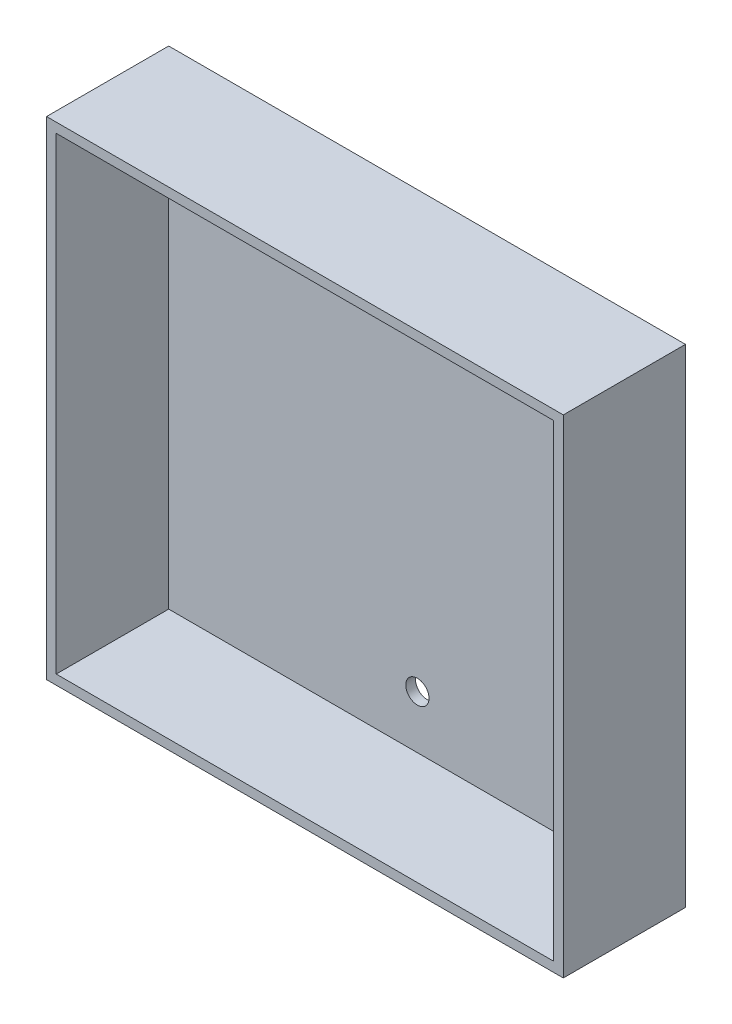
ISO-10303-21;
HEADER;
FILE_DESCRIPTION(('STEP AP214'),'2;1');
FILE_NAME('part.step','',(''),(''),'','','');
FILE_SCHEMA(('AUTOMOTIVE_DESIGN { 1 0 10303 214 1 1 1 1 }'));
ENDSEC;
DATA;
#1=APPLICATION_CONTEXT('core data for automotive mechanical design processes');
#2=APPLICATION_PROTOCOL_DEFINITION('international standard','automotive_design',2000,#1);
#3=PRODUCT_CONTEXT('',#1,'mechanical');
#4=PRODUCT('Part','Part','',(#3));
#5=PRODUCT_RELATED_PRODUCT_CATEGORY('part','',(#4));
#6=PRODUCT_DEFINITION_FORMATION('','',#4);
#7=PRODUCT_DEFINITION_CONTEXT('part definition',#1,'design');
#8=PRODUCT_DEFINITION('design','',#6,#7);
#9=PRODUCT_DEFINITION_SHAPE('','',#8);
#10=(LENGTH_UNIT() NAMED_UNIT(*) SI_UNIT(.MILLI.,.METRE.));
#11=(NAMED_UNIT(*) PLANE_ANGLE_UNIT() SI_UNIT($,.RADIAN.));
#12=(NAMED_UNIT(*) SI_UNIT($,.STERADIAN.) SOLID_ANGLE_UNIT());
#13=UNCERTAINTY_MEASURE_WITH_UNIT(LENGTH_MEASURE(1.E-05),#10,'distance_accuracy_value','');
#14=(GEOMETRIC_REPRESENTATION_CONTEXT(3) GLOBAL_UNCERTAINTY_ASSIGNED_CONTEXT((#13)) GLOBAL_UNIT_ASSIGNED_CONTEXT((#10,
#11,#12)) REPRESENTATION_CONTEXT('',''));
#15=CARTESIAN_POINT('',(0.,0.,0.));
#16=DIRECTION('',(0.,0.,1.));
#17=DIRECTION('',(1.,0.,0.));
#18=AXIS2_PLACEMENT_3D('',#15,#16,#17);
#19=CARTESIAN_POINT('',(0.,50.3,12.6));
#20=DIRECTION('',(0.,0.,-1.));
#21=DIRECTION('',(-1.,0.,0.));
#22=AXIS2_PLACEMENT_3D('',#19,#20,#21);
#23=PLANE('',#22);
#24=DIRECTION('',(0.,-1.,0.));
#25=VECTOR('',#24,1.);
#26=CARTESIAN_POINT('',(0.,0.,12.6));
#27=LINE('',#26,#25);
#28=CARTESIAN_POINT('',(0.,50.3,12.6));
#29=VERTEX_POINT('',#28);
#30=CARTESIAN_POINT('',(0.,0.,12.6));
#31=VERTEX_POINT('',#30);
#32=EDGE_CURVE('E135',#29,#31,#27,.T.);
#33=ORIENTED_EDGE('',*,*,#32,.T.);
#34=DIRECTION('',(1.,0.,0.));
#35=VECTOR('',#34,1.);
#36=CARTESIAN_POINT('',(0.,0.,12.6));
#37=LINE('',#36,#35);
#38=CARTESIAN_POINT('',(53.3,0.,12.6));
#39=VERTEX_POINT('',#38);
#40=EDGE_CURVE('E137',#31,#39,#37,.T.);
#41=ORIENTED_EDGE('',*,*,#40,.T.);
#42=DIRECTION('',(0.,1.,0.));
#43=VECTOR('',#42,1.);
#44=CARTESIAN_POINT('',(53.3,0.,12.6));
#45=LINE('',#44,#43);
#46=CARTESIAN_POINT('',(53.3,50.3,12.6));
#47=VERTEX_POINT('',#46);
#48=EDGE_CURVE('E139',#39,#47,#45,.T.);
#49=ORIENTED_EDGE('',*,*,#48,.T.);
#50=DIRECTION('',(-1.,0.,0.));
#51=VECTOR('',#50,1.);
#52=CARTESIAN_POINT('',(0.,50.3,12.6));
#53=LINE('',#52,#51);
#54=EDGE_CURVE('E49',#47,#29,#53,.T.);
#55=ORIENTED_EDGE('',*,*,#54,.T.);
#56=EDGE_LOOP('',(#33,#41,#49,#55));
#57=FACE_BOUND('',#56,.T.);
#58=DIRECTION('',(0.,-1.,0.));
#59=VECTOR('',#58,1.);
#60=CARTESIAN_POINT('',(1.,50.3,12.6));
#61=LINE('',#60,#59);
#62=CARTESIAN_POINT('',(1.,49.3,12.6));
#63=VERTEX_POINT('',#62);
#64=CARTESIAN_POINT('',(1.,1.,12.6));
#65=VERTEX_POINT('',#64);
#66=EDGE_CURVE('E115',#63,#65,#61,.T.);
#67=ORIENTED_EDGE('',*,*,#66,.F.);
#68=DIRECTION('',(-1.,0.,0.));
#69=VECTOR('',#68,1.);
#70=CARTESIAN_POINT('',(0.,49.3,12.6));
#71=LINE('',#70,#69);
#72=CARTESIAN_POINT('',(52.3,49.3,12.6));
#73=VERTEX_POINT('',#72);
#74=EDGE_CURVE('E124',#73,#63,#71,.T.);
#75=ORIENTED_EDGE('',*,*,#74,.F.);
#76=DIRECTION('',(0.,1.,0.));
#77=VECTOR('',#76,1.);
#78=CARTESIAN_POINT('',(52.3,50.3,12.6));
#79=LINE('',#78,#77);
#80=CARTESIAN_POINT('',(52.3,1.,12.6));
#81=VERTEX_POINT('',#80);
#82=EDGE_CURVE('E122',#81,#73,#79,.T.);
#83=ORIENTED_EDGE('',*,*,#82,.F.);
#84=DIRECTION('',(1.,0.,0.));
#85=VECTOR('',#84,1.);
#86=CARTESIAN_POINT('',(0.,1.,12.6));
#87=LINE('',#86,#85);
#88=EDGE_CURVE('E107',#65,#81,#87,.T.);
#89=ORIENTED_EDGE('',*,*,#88,.F.);
#90=EDGE_LOOP('',(#67,#75,#83,#89));
#91=FACE_BOUND('',#90,.T.);
#92=ADVANCED_FACE('F26',(#57,#91),#23,.F.);
#93=CARTESIAN_POINT('',(0.,0.,12.6));
#94=DIRECTION('',(1.,0.,0.));
#95=DIRECTION('',(0.,0.,-1.));
#96=AXIS2_PLACEMENT_3D('',#93,#94,#95);
#97=PLANE('',#96);
#98=DIRECTION('',(0.,-1.,0.));
#99=VECTOR('',#98,1.);
#100=CARTESIAN_POINT('',(0.,0.,0.));
#101=LINE('',#100,#99);
#102=CARTESIAN_POINT('',(0.,50.3,0.));
#103=VERTEX_POINT('',#102);
#104=CARTESIAN_POINT('',(0.,0.,0.));
#105=VERTEX_POINT('',#104);
#106=EDGE_CURVE('E126',#103,#105,#101,.T.);
#107=ORIENTED_EDGE('',*,*,#106,.T.);
#108=DIRECTION('',(0.,0.,-1.));
#109=VECTOR('',#108,1.);
#110=CARTESIAN_POINT('',(0.,0.,12.6));
#111=LINE('',#110,#109);
#112=EDGE_CURVE('E11',#31,#105,#111,.T.);
#113=ORIENTED_EDGE('',*,*,#112,.F.);
#114=ORIENTED_EDGE('',*,*,#32,.F.);
#115=DIRECTION('',(0.,0.,-1.));
#116=VECTOR('',#115,1.);
#117=CARTESIAN_POINT('',(0.,50.3,12.6));
#118=LINE('',#117,#116);
#119=EDGE_CURVE('E142',#29,#103,#118,.T.);
#120=ORIENTED_EDGE('',*,*,#119,.T.);
#121=EDGE_LOOP('',(#107,#113,#114,#120));
#122=FACE_BOUND('',#121,.T.);
#123=ADVANCED_FACE('F28',(#122),#97,.F.);
#124=CARTESIAN_POINT('',(0.,0.,12.6));
#125=DIRECTION('',(0.,1.,0.));
#126=DIRECTION('',(0.,0.,1.));
#127=AXIS2_PLACEMENT_3D('',#124,#125,#126);
#128=PLANE('',#127);
#129=DIRECTION('',(1.,0.,0.));
#130=VECTOR('',#129,1.);
#131=CARTESIAN_POINT('',(0.,0.,0.));
#132=LINE('',#131,#130);
#133=CARTESIAN_POINT('',(53.3,0.,0.));
#134=VERTEX_POINT('',#133);
#135=EDGE_CURVE('E129',#105,#134,#132,.T.);
#136=ORIENTED_EDGE('',*,*,#135,.T.);
#137=DIRECTION('',(0.,0.,-1.));
#138=VECTOR('',#137,1.);
#139=CARTESIAN_POINT('',(53.3,0.,12.6));
#140=LINE('',#139,#138);
#141=EDGE_CURVE('E34',#39,#134,#140,.T.);
#142=ORIENTED_EDGE('',*,*,#141,.F.);
#143=ORIENTED_EDGE('',*,*,#40,.F.);
#144=ORIENTED_EDGE('',*,*,#112,.T.);
#145=EDGE_LOOP('',(#136,#142,#143,#144));
#146=FACE_BOUND('',#145,.T.);
#147=ADVANCED_FACE('F165',(#146),#128,.F.);
#148=CARTESIAN_POINT('',(53.3,0.,12.6));
#149=DIRECTION('',(-1.,0.,0.));
#150=DIRECTION('',(0.,0.,1.));
#151=AXIS2_PLACEMENT_3D('',#148,#149,#150);
#152=PLANE('',#151);
#153=DIRECTION('',(0.,1.,0.));
#154=VECTOR('',#153,1.);
#155=CARTESIAN_POINT('',(53.3,0.,0.));
#156=LINE('',#155,#154);
#157=CARTESIAN_POINT('',(53.3,50.3,0.));
#158=VERTEX_POINT('',#157);
#159=EDGE_CURVE('E131',#134,#158,#156,.T.);
#160=ORIENTED_EDGE('',*,*,#159,.T.);
#161=DIRECTION('',(0.,0.,-1.));
#162=VECTOR('',#161,1.);
#163=CARTESIAN_POINT('',(53.3,50.3,12.6));
#164=LINE('',#163,#162);
#165=EDGE_CURVE('E145',#47,#158,#164,.T.);
#166=ORIENTED_EDGE('',*,*,#165,.F.);
#167=ORIENTED_EDGE('',*,*,#48,.F.);
#168=ORIENTED_EDGE('',*,*,#141,.T.);
#169=EDGE_LOOP('',(#160,#166,#167,#168));
#170=FACE_BOUND('',#169,.T.);
#171=ADVANCED_FACE('F152',(#170),#152,.F.);
#172=CARTESIAN_POINT('',(0.,50.3,12.6));
#173=DIRECTION('',(0.,-1.,0.));
#174=DIRECTION('',(0.,0.,-1.));
#175=AXIS2_PLACEMENT_3D('',#172,#173,#174);
#176=PLANE('',#175);
#177=DIRECTION('',(-1.,0.,0.));
#178=VECTOR('',#177,1.);
#179=CARTESIAN_POINT('',(0.,50.3,0.));
#180=LINE('',#179,#178);
#181=EDGE_CURVE('E133',#158,#103,#180,.T.);
#182=ORIENTED_EDGE('',*,*,#181,.T.);
#183=ORIENTED_EDGE('',*,*,#119,.F.);
#184=ORIENTED_EDGE('',*,*,#54,.F.);
#185=ORIENTED_EDGE('',*,*,#165,.T.);
#186=EDGE_LOOP('',(#182,#183,#184,#185));
#187=FACE_BOUND('',#186,.T.);
#188=ADVANCED_FACE('F160',(#187),#176,.F.);
#189=CARTESIAN_POINT('',(0.,50.3,0.));
#190=DIRECTION('',(0.,0.,-1.));
#191=DIRECTION('',(-1.,0.,0.));
#192=AXIS2_PLACEMENT_3D('',#189,#190,#191);
#193=PLANE('',#192);
#194=CARTESIAN_POINT('',(26.65,6.45,0.));
#195=DIRECTION('',(0.,0.,1.));
#196=DIRECTION('',(1.,0.,0.));
#197=AXIS2_PLACEMENT_3D('',#194,#195,#196);
#198=CIRCLE('',#197,1.2);
#199=CARTESIAN_POINT('',(27.85,6.45,0.));
#200=VERTEX_POINT('',#199);
#201=EDGE_CURVE('E195',#200,#200,#198,.T.);
#202=ORIENTED_EDGE('',*,*,#201,.T.);
#203=EDGE_LOOP('',(#202));
#204=FACE_BOUND('',#203,.T.);
#205=CARTESIAN_POINT('',(26.65,43.85,0.));
#206=DIRECTION('',(0.,0.,1.));
#207=DIRECTION('',(1.,0.,0.));
#208=AXIS2_PLACEMENT_3D('',#205,#206,#207);
#209=CIRCLE('',#208,1.2);
#210=CARTESIAN_POINT('',(27.85,43.85,0.));
#211=VERTEX_POINT('',#210);
#212=EDGE_CURVE('E198',#211,#211,#209,.T.);
#213=ORIENTED_EDGE('',*,*,#212,.T.);
#214=EDGE_LOOP('',(#213));
#215=FACE_BOUND('',#214,.T.);
#216=ORIENTED_EDGE('',*,*,#106,.F.);
#217=ORIENTED_EDGE('',*,*,#181,.F.);
#218=ORIENTED_EDGE('',*,*,#159,.F.);
#219=ORIENTED_EDGE('',*,*,#135,.F.);
#220=EDGE_LOOP('',(#216,#217,#218,#219));
#221=FACE_BOUND('',#220,.T.);
#222=ADVANCED_FACE('F158',(#204,#215,#221),#193,.T.);
#223=CARTESIAN_POINT('',(1.,0.,12.6));
#224=DIRECTION('',(1.,0.,0.));
#225=DIRECTION('',(0.,0.,-1.));
#226=AXIS2_PLACEMENT_3D('',#223,#224,#225);
#227=PLANE('',#226);
#228=DIRECTION('',(0.,-1.,0.));
#229=VECTOR('',#228,1.);
#230=CARTESIAN_POINT('',(1.,50.3,1.));
#231=LINE('',#230,#229);
#232=CARTESIAN_POINT('',(1.,49.3,1.));
#233=VERTEX_POINT('',#232);
#234=CARTESIAN_POINT('',(1.,1.,1.));
#235=VERTEX_POINT('',#234);
#236=EDGE_CURVE('E98',#233,#235,#231,.T.);
#237=ORIENTED_EDGE('',*,*,#236,.F.);
#238=DIRECTION('',(0.,0.,-1.));
#239=VECTOR('',#238,1.);
#240=CARTESIAN_POINT('',(1.,49.3,12.6));
#241=LINE('',#240,#239);
#242=EDGE_CURVE('E118',#63,#233,#241,.T.);
#243=ORIENTED_EDGE('',*,*,#242,.F.);
#244=ORIENTED_EDGE('',*,*,#66,.T.);
#245=DIRECTION('',(0.,0.,-1.));
#246=VECTOR('',#245,1.);
#247=CARTESIAN_POINT('',(1.,1.,12.6));
#248=LINE('',#247,#246);
#249=EDGE_CURVE('E110',#65,#235,#248,.T.);
#250=ORIENTED_EDGE('',*,*,#249,.T.);
#251=EDGE_LOOP('',(#237,#243,#244,#250));
#252=FACE_BOUND('',#251,.T.);
#253=ADVANCED_FACE('F184',(#252),#227,.T.);
#254=CARTESIAN_POINT('',(0.,1.,12.6));
#255=DIRECTION('',(0.,1.,0.));
#256=DIRECTION('',(0.,0.,1.));
#257=AXIS2_PLACEMENT_3D('',#254,#255,#256);
#258=PLANE('',#257);
#259=DIRECTION('',(1.,0.,0.));
#260=VECTOR('',#259,1.);
#261=CARTESIAN_POINT('',(0.,1.,1.));
#262=LINE('',#261,#260);
#263=CARTESIAN_POINT('',(52.3,1.,1.));
#264=VERTEX_POINT('',#263);
#265=EDGE_CURVE('E92',#235,#264,#262,.T.);
#266=ORIENTED_EDGE('',*,*,#265,.F.);
#267=ORIENTED_EDGE('',*,*,#249,.F.);
#268=ORIENTED_EDGE('',*,*,#88,.T.);
#269=DIRECTION('',(0.,0.,-1.));
#270=VECTOR('',#269,1.);
#271=CARTESIAN_POINT('',(52.3,1.,12.6));
#272=LINE('',#271,#270);
#273=EDGE_CURVE('E104',#81,#264,#272,.T.);
#274=ORIENTED_EDGE('',*,*,#273,.T.);
#275=EDGE_LOOP('',(#266,#267,#268,#274));
#276=FACE_BOUND('',#275,.T.);
#277=ADVANCED_FACE('F105',(#276),#258,.T.);
#278=CARTESIAN_POINT('',(52.3,0.,12.6));
#279=DIRECTION('',(-1.,0.,0.));
#280=DIRECTION('',(0.,0.,1.));
#281=AXIS2_PLACEMENT_3D('',#278,#279,#280);
#282=PLANE('',#281);
#283=DIRECTION('',(0.,1.,0.));
#284=VECTOR('',#283,1.);
#285=CARTESIAN_POINT('',(52.3,50.3,1.));
#286=LINE('',#285,#284);
#287=CARTESIAN_POINT('',(52.3,49.3,1.));
#288=VERTEX_POINT('',#287);
#289=EDGE_CURVE('E96',#264,#288,#286,.T.);
#290=ORIENTED_EDGE('',*,*,#289,.F.);
#291=ORIENTED_EDGE('',*,*,#273,.F.);
#292=ORIENTED_EDGE('',*,*,#82,.T.);
#293=DIRECTION('',(0.,0.,-1.));
#294=VECTOR('',#293,1.);
#295=CARTESIAN_POINT('',(52.3,49.3,12.6));
#296=LINE('',#295,#294);
#297=EDGE_CURVE('E41',#73,#288,#296,.T.);
#298=ORIENTED_EDGE('',*,*,#297,.T.);
#299=EDGE_LOOP('',(#290,#291,#292,#298));
#300=FACE_BOUND('',#299,.T.);
#301=ADVANCED_FACE('F112',(#300),#282,.T.);
#302=CARTESIAN_POINT('',(0.,49.3,12.6));
#303=DIRECTION('',(0.,-1.,0.));
#304=DIRECTION('',(0.,0.,-1.));
#305=AXIS2_PLACEMENT_3D('',#302,#303,#304);
#306=PLANE('',#305);
#307=DIRECTION('',(-1.,0.,0.));
#308=VECTOR('',#307,1.);
#309=CARTESIAN_POINT('',(0.,49.3,1.));
#310=LINE('',#309,#308);
#311=EDGE_CURVE('E113',#288,#233,#310,.T.);
#312=ORIENTED_EDGE('',*,*,#311,.F.);
#313=ORIENTED_EDGE('',*,*,#297,.F.);
#314=ORIENTED_EDGE('',*,*,#74,.T.);
#315=ORIENTED_EDGE('',*,*,#242,.T.);
#316=EDGE_LOOP('',(#312,#313,#314,#315));
#317=FACE_BOUND('',#316,.T.);
#318=ADVANCED_FACE('F210',(#317),#306,.T.);
#319=CARTESIAN_POINT('',(0.,50.3,1.));
#320=DIRECTION('',(0.,0.,-1.));
#321=DIRECTION('',(-1.,0.,0.));
#322=AXIS2_PLACEMENT_3D('',#319,#320,#321);
#323=PLANE('',#322);
#324=CARTESIAN_POINT('',(26.65,6.45,1.));
#325=DIRECTION('',(0.,0.,1.));
#326=DIRECTION('',(1.,0.,0.));
#327=AXIS2_PLACEMENT_3D('',#324,#325,#326);
#328=CIRCLE('',#327,1.2);
#329=CARTESIAN_POINT('',(27.85,6.45,1.));
#330=VERTEX_POINT('',#329);
#331=EDGE_CURVE('E233',#330,#330,#328,.T.);
#332=ORIENTED_EDGE('',*,*,#331,.F.);
#333=EDGE_LOOP('',(#332));
#334=FACE_BOUND('',#333,.T.);
#335=CARTESIAN_POINT('',(26.65,43.85,1.));
#336=DIRECTION('',(0.,0.,1.));
#337=DIRECTION('',(1.,0.,0.));
#338=AXIS2_PLACEMENT_3D('',#335,#336,#337);
#339=CIRCLE('',#338,1.2);
#340=CARTESIAN_POINT('',(27.85,43.85,1.));
#341=VERTEX_POINT('',#340);
#342=EDGE_CURVE('E200',#341,#341,#339,.T.);
#343=ORIENTED_EDGE('',*,*,#342,.F.);
#344=EDGE_LOOP('',(#343));
#345=FACE_BOUND('',#344,.T.);
#346=ORIENTED_EDGE('',*,*,#236,.T.);
#347=ORIENTED_EDGE('',*,*,#265,.T.);
#348=ORIENTED_EDGE('',*,*,#289,.T.);
#349=ORIENTED_EDGE('',*,*,#311,.T.);
#350=EDGE_LOOP('',(#346,#347,#348,#349));
#351=FACE_BOUND('',#350,.T.);
#352=ADVANCED_FACE('F94',(#334,#345,#351),#323,.F.);
#353=CARTESIAN_POINT('',(26.65,43.85,0.));
#354=DIRECTION('',(0.,0.,1.));
#355=DIRECTION('',(1.,0.,0.));
#356=AXIS2_PLACEMENT_3D('',#353,#354,#355);
#357=CYLINDRICAL_SURFACE('',#356,1.2);
#358=ORIENTED_EDGE('',*,*,#212,.F.);
#359=EDGE_LOOP('',(#358));
#360=FACE_BOUND('',#359,.T.);
#361=ORIENTED_EDGE('',*,*,#342,.T.);
#362=EDGE_LOOP('',(#361));
#363=FACE_BOUND('',#362,.T.);
#364=ADVANCED_FACE('F217',(#360,#363),#357,.F.);
#365=CARTESIAN_POINT('',(26.65,6.45,0.));
#366=DIRECTION('',(0.,0.,1.));
#367=DIRECTION('',(1.,0.,0.));
#368=AXIS2_PLACEMENT_3D('',#365,#366,#367);
#369=CYLINDRICAL_SURFACE('',#368,1.2);
#370=ORIENTED_EDGE('',*,*,#201,.F.);
#371=EDGE_LOOP('',(#370));
#372=FACE_BOUND('',#371,.T.);
#373=ORIENTED_EDGE('',*,*,#331,.T.);
#374=EDGE_LOOP('',(#373));
#375=FACE_BOUND('',#374,.T.);
#376=ADVANCED_FACE('F225',(#372,#375),#369,.F.);
#377=CLOSED_SHELL('',(#92,#123,#147,#171,#188,#222,#253,#277,#301,#318,#352,#364,#376));
#378=MANIFOLD_SOLID_BREP('B2',#377);
#379=ADVANCED_BREP_SHAPE_REPRESENTATION('',(#18,#378),#14);
#380=SHAPE_DEFINITION_REPRESENTATION(#9,#379);
ENDSEC;
END-ISO-10303-21;
